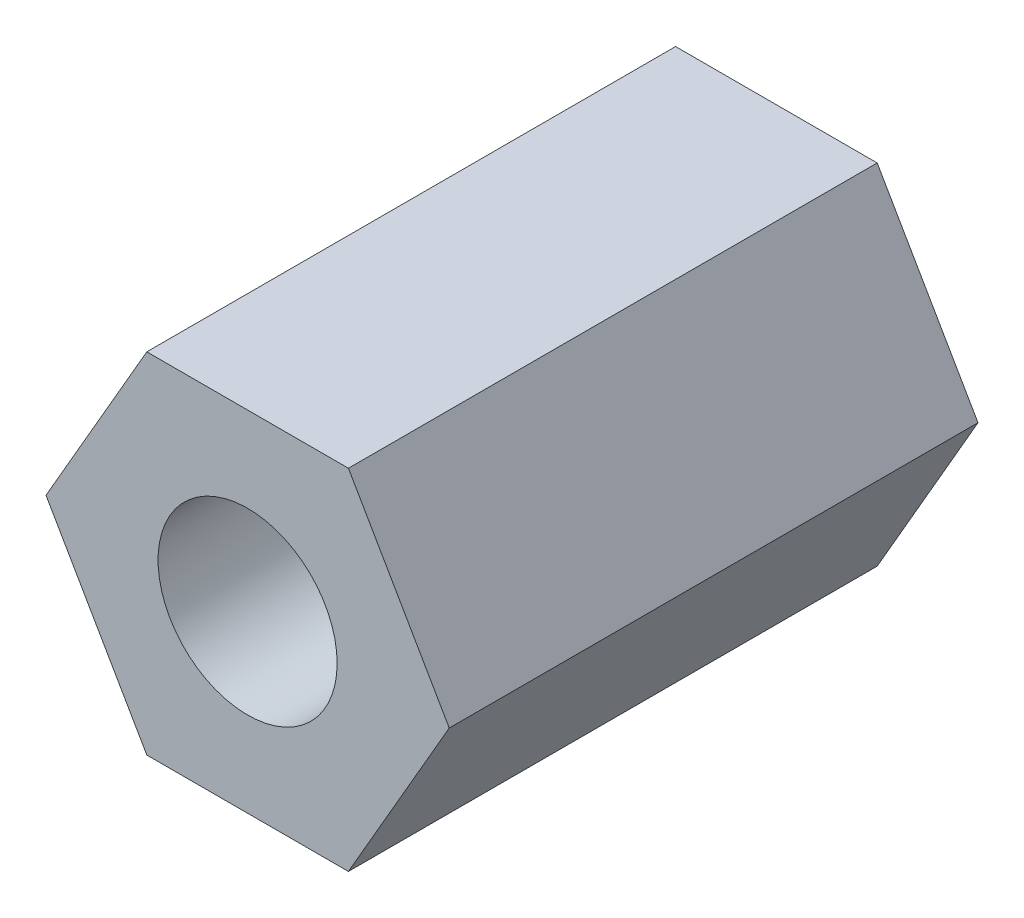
ISO-10303-21;
HEADER;
FILE_DESCRIPTION(('STEP AP214'),'2;1');
FILE_NAME('part.step','',(''),(''),'','','');
FILE_SCHEMA(('AUTOMOTIVE_DESIGN { 1 0 10303 214 1 1 1 1 }'));
ENDSEC;
DATA;
#1=APPLICATION_CONTEXT('core data for automotive mechanical design processes');
#2=APPLICATION_PROTOCOL_DEFINITION('international standard','automotive_design',2000,#1);
#3=PRODUCT_CONTEXT('',#1,'mechanical');
#4=PRODUCT('Part','Part','',(#3));
#5=PRODUCT_RELATED_PRODUCT_CATEGORY('part','',(#4));
#6=PRODUCT_DEFINITION_FORMATION('','',#4);
#7=PRODUCT_DEFINITION_CONTEXT('part definition',#1,'design');
#8=PRODUCT_DEFINITION('design','',#6,#7);
#9=PRODUCT_DEFINITION_SHAPE('','',#8);
#10=(LENGTH_UNIT() NAMED_UNIT(*) SI_UNIT(.MILLI.,.METRE.));
#11=(NAMED_UNIT(*) PLANE_ANGLE_UNIT() SI_UNIT($,.RADIAN.));
#12=(NAMED_UNIT(*) SI_UNIT($,.STERADIAN.) SOLID_ANGLE_UNIT());
#13=UNCERTAINTY_MEASURE_WITH_UNIT(LENGTH_MEASURE(1.E-05),#10,'distance_accuracy_value','');
#14=(GEOMETRIC_REPRESENTATION_CONTEXT(3) GLOBAL_UNCERTAINTY_ASSIGNED_CONTEXT((#13)) GLOBAL_UNIT_ASSIGNED_CONTEXT((#10,
#11,#12)) REPRESENTATION_CONTEXT('',''));
#15=CARTESIAN_POINT('',(0.,0.,0.));
#16=DIRECTION('',(0.,0.,1.));
#17=DIRECTION('',(1.,0.,0.));
#18=AXIS2_PLACEMENT_3D('',#15,#16,#17);
#19=CARTESIAN_POINT('',(2.28769270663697,0.,3.));
#20=DIRECTION('',(-0.866025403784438,-0.500000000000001,0.));
#21=DIRECTION('',(0.500000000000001,-0.866025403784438,0.));
#22=AXIS2_PLACEMENT_3D('',#19,#20,#21);
#23=PLANE('',#22);
#24=DIRECTION('',(-0.5,0.866025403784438,0.));
#25=VECTOR('',#24,1.);
#26=CARTESIAN_POINT('',(2.28769270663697,0.,-3.));
#27=LINE('',#26,#25);
#28=CARTESIAN_POINT('',(2.28769270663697,0.,-3.));
#29=VERTEX_POINT('',#28);
#30=CARTESIAN_POINT('',(1.14384635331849,1.9812,-3.));
#31=VERTEX_POINT('',#30);
#32=EDGE_CURVE('E122',#29,#31,#27,.T.);
#33=ORIENTED_EDGE('',*,*,#32,.T.);
#34=DIRECTION('',(0.,0.,-1.));
#35=VECTOR('',#34,1.);
#36=CARTESIAN_POINT('',(1.14384635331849,1.9812,3.));
#37=LINE('',#36,#35);
#38=CARTESIAN_POINT('',(1.14384635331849,1.9812,3.));
#39=VERTEX_POINT('',#38);
#40=EDGE_CURVE('E11',#39,#31,#37,.T.);
#41=ORIENTED_EDGE('',*,*,#40,.F.);
#42=DIRECTION('',(-0.5,0.866025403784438,0.));
#43=VECTOR('',#42,1.);
#44=CARTESIAN_POINT('',(2.28769270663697,0.,3.));
#45=LINE('',#44,#43);
#46=CARTESIAN_POINT('',(2.28769270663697,0.,3.));
#47=VERTEX_POINT('',#46);
#48=EDGE_CURVE('E133',#47,#39,#45,.T.);
#49=ORIENTED_EDGE('',*,*,#48,.F.);
#50=DIRECTION('',(0.,0.,-1.));
#51=VECTOR('',#50,1.);
#52=CARTESIAN_POINT('',(2.28769270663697,0.,3.));
#53=LINE('',#52,#51);
#54=EDGE_CURVE('E118',#47,#29,#53,.T.);
#55=ORIENTED_EDGE('',*,*,#54,.T.);
#56=EDGE_LOOP('',(#33,#41,#49,#55));
#57=FACE_BOUND('',#56,.T.);
#58=ADVANCED_FACE('F38',(#57),#23,.F.);
#59=CARTESIAN_POINT('',(1.14384635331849,1.9812,3.));
#60=DIRECTION('',(0.,-1.,0.));
#61=DIRECTION('',(0.,0.,-1.));
#62=AXIS2_PLACEMENT_3D('',#59,#60,#61);
#63=PLANE('',#62);
#64=DIRECTION('',(-1.,0.,0.));
#65=VECTOR('',#64,1.);
#66=CARTESIAN_POINT('',(1.14384635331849,1.9812,-3.));
#67=LINE('',#66,#65);
#68=CARTESIAN_POINT('',(-1.14384635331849,1.9812,-3.));
#69=VERTEX_POINT('',#68);
#70=EDGE_CURVE('E125',#31,#69,#67,.T.);
#71=ORIENTED_EDGE('',*,*,#70,.T.);
#72=DIRECTION('',(0.,0.,-1.));
#73=VECTOR('',#72,1.);
#74=CARTESIAN_POINT('',(-1.14384635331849,1.9812,3.));
#75=LINE('',#74,#73);
#76=CARTESIAN_POINT('',(-1.14384635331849,1.9812,3.));
#77=VERTEX_POINT('',#76);
#78=EDGE_CURVE('E46',#77,#69,#75,.T.);
#79=ORIENTED_EDGE('',*,*,#78,.F.);
#80=DIRECTION('',(-1.,0.,0.));
#81=VECTOR('',#80,1.);
#82=CARTESIAN_POINT('',(1.14384635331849,1.9812,3.));
#83=LINE('',#82,#81);
#84=EDGE_CURVE('E91',#39,#77,#83,.T.);
#85=ORIENTED_EDGE('',*,*,#84,.F.);
#86=ORIENTED_EDGE('',*,*,#40,.T.);
#87=EDGE_LOOP('',(#71,#79,#85,#86));
#88=FACE_BOUND('',#87,.T.);
#89=ADVANCED_FACE('F158',(#88),#63,.F.);
#90=CARTESIAN_POINT('',(-1.14384635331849,1.9812,3.));
#91=DIRECTION('',(0.866025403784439,-0.5,0.));
#92=DIRECTION('',(0.5,0.866025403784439,0.));
#93=AXIS2_PLACEMENT_3D('',#90,#91,#92);
#94=PLANE('',#93);
#95=DIRECTION('',(-0.5,-0.866025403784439,0.));
#96=VECTOR('',#95,1.);
#97=CARTESIAN_POINT('',(-1.14384635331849,1.9812,-3.));
#98=LINE('',#97,#96);
#99=CARTESIAN_POINT('',(-2.28769270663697,0.,-3.));
#100=VERTEX_POINT('',#99);
#101=EDGE_CURVE('E128',#69,#100,#98,.T.);
#102=ORIENTED_EDGE('',*,*,#101,.T.);
#103=DIRECTION('',(0.,0.,-1.));
#104=VECTOR('',#103,1.);
#105=CARTESIAN_POINT('',(-2.28769270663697,0.,3.));
#106=LINE('',#105,#104);
#107=CARTESIAN_POINT('',(-2.28769270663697,0.,3.));
#108=VERTEX_POINT('',#107);
#109=EDGE_CURVE('E113',#108,#100,#106,.T.);
#110=ORIENTED_EDGE('',*,*,#109,.F.);
#111=DIRECTION('',(-0.5,-0.866025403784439,0.));
#112=VECTOR('',#111,1.);
#113=CARTESIAN_POINT('',(-1.14384635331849,1.9812,3.));
#114=LINE('',#113,#112);
#115=EDGE_CURVE('E104',#77,#108,#114,.T.);
#116=ORIENTED_EDGE('',*,*,#115,.F.);
#117=ORIENTED_EDGE('',*,*,#78,.T.);
#118=EDGE_LOOP('',(#102,#110,#116,#117));
#119=FACE_BOUND('',#118,.T.);
#120=ADVANCED_FACE('F139',(#119),#94,.F.);
#121=CARTESIAN_POINT('',(-2.28769270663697,0.,3.));
#122=DIRECTION('',(0.866025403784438,0.500000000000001,0.));
#123=DIRECTION('',(-0.500000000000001,0.866025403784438,0.));
#124=AXIS2_PLACEMENT_3D('',#121,#122,#123);
#125=PLANE('',#124);
#126=DIRECTION('',(0.500000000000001,-0.866025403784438,0.));
#127=VECTOR('',#126,1.);
#128=CARTESIAN_POINT('',(-2.28769270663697,0.,-3.));
#129=LINE('',#128,#127);
#130=CARTESIAN_POINT('',(-1.14384635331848,-1.9812,-3.));
#131=VERTEX_POINT('',#130);
#132=EDGE_CURVE('E112',#100,#131,#129,.T.);
#133=ORIENTED_EDGE('',*,*,#132,.T.);
#134=DIRECTION('',(0.,0.,-1.));
#135=VECTOR('',#134,1.);
#136=CARTESIAN_POINT('',(-1.14384635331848,-1.9812,3.));
#137=LINE('',#136,#135);
#138=CARTESIAN_POINT('',(-1.14384635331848,-1.9812,3.));
#139=VERTEX_POINT('',#138);
#140=EDGE_CURVE('E109',#139,#131,#137,.T.);
#141=ORIENTED_EDGE('',*,*,#140,.F.);
#142=DIRECTION('',(0.500000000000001,-0.866025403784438,0.));
#143=VECTOR('',#142,1.);
#144=CARTESIAN_POINT('',(-2.28769270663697,0.,3.));
#145=LINE('',#144,#143);
#146=EDGE_CURVE('E98',#108,#139,#145,.T.);
#147=ORIENTED_EDGE('',*,*,#146,.F.);
#148=ORIENTED_EDGE('',*,*,#109,.T.);
#149=EDGE_LOOP('',(#133,#141,#147,#148));
#150=FACE_BOUND('',#149,.T.);
#151=ADVANCED_FACE('F110',(#150),#125,.F.);
#152=CARTESIAN_POINT('',(-1.14384635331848,-1.9812,3.));
#153=DIRECTION('',(0.,1.,0.));
#154=DIRECTION('',(-1.,0.,0.));
#155=AXIS2_PLACEMENT_3D('',#152,#153,#154);
#156=PLANE('',#155);
#157=DIRECTION('',(1.,0.,0.));
#158=VECTOR('',#157,1.);
#159=CARTESIAN_POINT('',(-1.14384635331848,-1.9812,-3.));
#160=LINE('',#159,#158);
#161=CARTESIAN_POINT('',(1.14384635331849,-1.9812,-3.));
#162=VERTEX_POINT('',#161);
#163=EDGE_CURVE('E77',#131,#162,#160,.T.);
#164=ORIENTED_EDGE('',*,*,#163,.T.);
#165=DIRECTION('',(0.,0.,-1.));
#166=VECTOR('',#165,1.);
#167=CARTESIAN_POINT('',(1.14384635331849,-1.9812,3.));
#168=LINE('',#167,#166);
#169=CARTESIAN_POINT('',(1.14384635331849,-1.9812,3.));
#170=VERTEX_POINT('',#169);
#171=EDGE_CURVE('E114',#170,#162,#168,.T.);
#172=ORIENTED_EDGE('',*,*,#171,.F.);
#173=DIRECTION('',(1.,0.,0.));
#174=VECTOR('',#173,1.);
#175=CARTESIAN_POINT('',(-1.14384635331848,-1.9812,3.));
#176=LINE('',#175,#174);
#177=EDGE_CURVE('E102',#139,#170,#176,.T.);
#178=ORIENTED_EDGE('',*,*,#177,.F.);
#179=ORIENTED_EDGE('',*,*,#140,.T.);
#180=EDGE_LOOP('',(#164,#172,#178,#179));
#181=FACE_BOUND('',#180,.T.);
#182=ADVANCED_FACE('F116',(#181),#156,.F.);
#183=CARTESIAN_POINT('',(1.14384635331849,-1.9812,3.));
#184=DIRECTION('',(-0.866025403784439,0.5,0.));
#185=DIRECTION('',(-0.5,-0.866025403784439,0.));
#186=AXIS2_PLACEMENT_3D('',#183,#184,#185);
#187=PLANE('',#186);
#188=DIRECTION('',(0.5,0.866025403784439,0.));
#189=VECTOR('',#188,1.);
#190=CARTESIAN_POINT('',(1.14384635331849,-1.9812,-3.));
#191=LINE('',#190,#189);
#192=EDGE_CURVE('E83',#162,#29,#191,.T.);
#193=ORIENTED_EDGE('',*,*,#192,.T.);
#194=ORIENTED_EDGE('',*,*,#54,.F.);
#195=DIRECTION('',(0.5,0.866025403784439,0.));
#196=VECTOR('',#195,1.);
#197=CARTESIAN_POINT('',(1.14384635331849,-1.9812,3.));
#198=LINE('',#197,#196);
#199=EDGE_CURVE('E54',#170,#47,#198,.T.);
#200=ORIENTED_EDGE('',*,*,#199,.F.);
#201=ORIENTED_EDGE('',*,*,#171,.T.);
#202=EDGE_LOOP('',(#193,#194,#200,#201));
#203=FACE_BOUND('',#202,.T.);
#204=ADVANCED_FACE('F146',(#203),#187,.F.);
#205=CARTESIAN_POINT('',(0.,0.,3.));
#206=DIRECTION('',(0.,0.,1.));
#207=DIRECTION('',(1.,0.,0.));
#208=AXIS2_PLACEMENT_3D('',#205,#206,#207);
#209=PLANE('',#208);
#210=CARTESIAN_POINT('',(0.,0.,3.));
#211=DIRECTION('',(0.,0.,1.));
#212=DIRECTION('',(1.,0.,0.));
#213=AXIS2_PLACEMENT_3D('',#210,#211,#212);
#214=CIRCLE('',#213,1.016);
#215=CARTESIAN_POINT('',(1.016,0.,3.));
#216=VERTEX_POINT('',#215);
#217=EDGE_CURVE('E126',#216,#216,#214,.T.);
#218=ORIENTED_EDGE('',*,*,#217,.F.);
#219=EDGE_LOOP('',(#218));
#220=FACE_BOUND('',#219,.T.);
#221=ORIENTED_EDGE('',*,*,#48,.T.);
#222=ORIENTED_EDGE('',*,*,#84,.T.);
#223=ORIENTED_EDGE('',*,*,#115,.T.);
#224=ORIENTED_EDGE('',*,*,#146,.T.);
#225=ORIENTED_EDGE('',*,*,#177,.T.);
#226=ORIENTED_EDGE('',*,*,#199,.T.);
#227=EDGE_LOOP('',(#221,#222,#223,#224,#225,#226));
#228=FACE_BOUND('',#227,.T.);
#229=ADVANCED_FACE('F100',(#220,#228),#209,.T.);
#230=CARTESIAN_POINT('',(0.,0.,-3.));
#231=DIRECTION('',(0.,0.,1.));
#232=DIRECTION('',(1.,0.,0.));
#233=AXIS2_PLACEMENT_3D('',#230,#231,#232);
#234=PLANE('',#233);
#235=CARTESIAN_POINT('',(0.,0.,-3.));
#236=DIRECTION('',(0.,0.,1.));
#237=DIRECTION('',(1.,0.,0.));
#238=AXIS2_PLACEMENT_3D('',#235,#236,#237);
#239=CIRCLE('',#238,1.016);
#240=CARTESIAN_POINT('',(1.016,0.,-3.));
#241=VERTEX_POINT('',#240);
#242=EDGE_CURVE('E214',#241,#241,#239,.T.);
#243=ORIENTED_EDGE('',*,*,#242,.T.);
#244=EDGE_LOOP('',(#243));
#245=FACE_BOUND('',#244,.T.);
#246=ORIENTED_EDGE('',*,*,#32,.F.);
#247=ORIENTED_EDGE('',*,*,#192,.F.);
#248=ORIENTED_EDGE('',*,*,#163,.F.);
#249=ORIENTED_EDGE('',*,*,#132,.F.);
#250=ORIENTED_EDGE('',*,*,#101,.F.);
#251=ORIENTED_EDGE('',*,*,#70,.F.);
#252=EDGE_LOOP('',(#246,#247,#248,#249,#250,#251));
#253=FACE_BOUND('',#252,.T.);
#254=ADVANCED_FACE('F142',(#245,#253),#234,.F.);
#255=CARTESIAN_POINT('',(0.,0.,-3.));
#256=DIRECTION('',(0.,0.,1.));
#257=DIRECTION('',(1.,0.,0.));
#258=AXIS2_PLACEMENT_3D('',#255,#256,#257);
#259=CYLINDRICAL_SURFACE('',#258,1.016);
#260=ORIENTED_EDGE('',*,*,#217,.T.);
#261=EDGE_LOOP('',(#260));
#262=FACE_BOUND('',#261,.T.);
#263=ORIENTED_EDGE('',*,*,#242,.F.);
#264=EDGE_LOOP('',(#263));
#265=FACE_BOUND('',#264,.T.);
#266=ADVANCED_FACE('F196',(#262,#265),#259,.F.);
#267=CLOSED_SHELL('',(#58,#89,#120,#151,#182,#204,#229,#254,#266));
#268=MANIFOLD_SOLID_BREP('B2',#267);
#269=ADVANCED_BREP_SHAPE_REPRESENTATION('',(#18,#268),#14);
#270=SHAPE_DEFINITION_REPRESENTATION(#9,#269);
ENDSEC;
END-ISO-10303-21;
